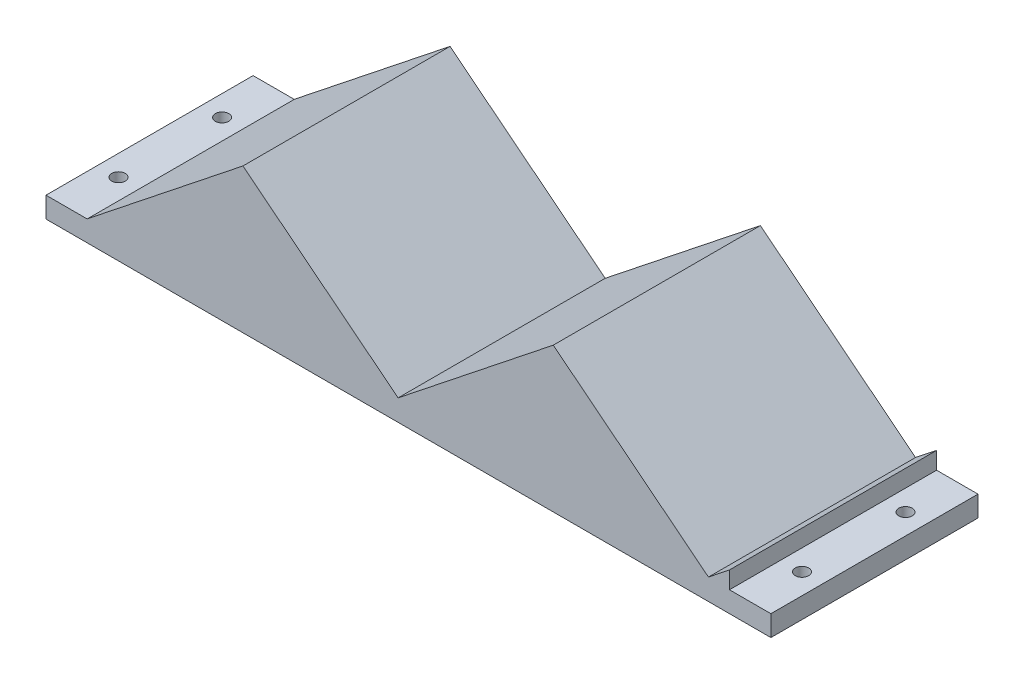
ISO-10303-21;
HEADER;
FILE_DESCRIPTION(('STEP AP214'),'2;1');
FILE_NAME('part.step','',(''),(''),'','','');
FILE_SCHEMA(('AUTOMOTIVE_DESIGN { 1 0 10303 214 1 1 1 1 }'));
ENDSEC;
DATA;
#1=APPLICATION_CONTEXT('core data for automotive mechanical design processes');
#2=APPLICATION_PROTOCOL_DEFINITION('international standard','automotive_design',2000,#1);
#3=PRODUCT_CONTEXT('',#1,'mechanical');
#4=PRODUCT('Part','Part','',(#3));
#5=PRODUCT_RELATED_PRODUCT_CATEGORY('part','',(#4));
#6=PRODUCT_DEFINITION_FORMATION('','',#4);
#7=PRODUCT_DEFINITION_CONTEXT('part definition',#1,'design');
#8=PRODUCT_DEFINITION('design','',#6,#7);
#9=PRODUCT_DEFINITION_SHAPE('','',#8);
#10=(LENGTH_UNIT() NAMED_UNIT(*) SI_UNIT(.MILLI.,.METRE.));
#11=(NAMED_UNIT(*) PLANE_ANGLE_UNIT() SI_UNIT($,.RADIAN.));
#12=(NAMED_UNIT(*) SI_UNIT($,.STERADIAN.) SOLID_ANGLE_UNIT());
#13=UNCERTAINTY_MEASURE_WITH_UNIT(LENGTH_MEASURE(1.E-05),#10,'distance_accuracy_value','');
#14=(GEOMETRIC_REPRESENTATION_CONTEXT(3) GLOBAL_UNCERTAINTY_ASSIGNED_CONTEXT((#13)) GLOBAL_UNIT_ASSIGNED_CONTEXT((#10,
#11,#12)) REPRESENTATION_CONTEXT('',''));
#15=CARTESIAN_POINT('',(0.,0.,0.));
#16=DIRECTION('',(0.,0.,1.));
#17=DIRECTION('',(1.,0.,0.));
#18=AXIS2_PLACEMENT_3D('',#15,#16,#17);
#19=CARTESIAN_POINT('',(75.080897,59.750065,100.));
#20=DIRECTION('',(-0.621900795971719,-0.783096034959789,0.));
#21=DIRECTION('',(0.783096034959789,-0.621900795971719,0.));
#22=AXIS2_PLACEMENT_3D('',#19,#20,#21);
#23=PLANE('',#22);
#24=DIRECTION('',(-0.783096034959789,0.621900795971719,0.));
#25=VECTOR('',#24,1.);
#26=CARTESIAN_POINT('',(75.080897,59.750065,0.));
#27=LINE('',#26,#25);
#28=CARTESIAN_POINT('',(150.005619,0.248111,0.));
#29=VERTEX_POINT('',#28);
#30=CARTESIAN_POINT('',(75.080897,59.750065,0.));
#31=VERTEX_POINT('',#30);
#32=EDGE_CURVE('E155',#29,#31,#27,.T.);
#33=ORIENTED_EDGE('',*,*,#32,.T.);
#34=DIRECTION('',(0.,0.,-1.));
#35=VECTOR('',#34,1.);
#36=CARTESIAN_POINT('',(75.080897,59.750065,100.));
#37=LINE('',#36,#35);
#38=CARTESIAN_POINT('',(75.080897,59.750065,100.));
#39=VERTEX_POINT('',#38);
#40=EDGE_CURVE('E11',#39,#31,#37,.T.);
#41=ORIENTED_EDGE('',*,*,#40,.F.);
#42=DIRECTION('',(-0.783096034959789,0.621900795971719,0.));
#43=VECTOR('',#42,1.);
#44=CARTESIAN_POINT('',(75.080897,59.750065,100.));
#45=LINE('',#44,#43);
#46=CARTESIAN_POINT('',(150.005619,0.248111,100.));
#47=VERTEX_POINT('',#46);
#48=EDGE_CURVE('E178',#47,#39,#45,.T.);
#49=ORIENTED_EDGE('',*,*,#48,.F.);
#50=DIRECTION('',(0.,0.,-1.));
#51=VECTOR('',#50,1.);
#52=CARTESIAN_POINT('',(150.005619,0.248111,100.));
#53=LINE('',#52,#51);
#54=EDGE_CURVE('E151',#47,#29,#53,.T.);
#55=ORIENTED_EDGE('',*,*,#54,.T.);
#56=EDGE_LOOP('',(#33,#41,#49,#55));
#57=FACE_BOUND('',#56,.T.);
#58=ADVANCED_FACE('F33',(#57),#23,.F.);
#59=CARTESIAN_POINT('',(0.,0.122664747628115,100.));
#60=DIRECTION('',(0.621909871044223,-0.783088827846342,0.));
#61=DIRECTION('',(0.783088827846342,0.621909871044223,0.));
#62=AXIS2_PLACEMENT_3D('',#59,#60,#61);
#63=PLANE('',#62);
#64=DIRECTION('',(-0.783088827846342,-0.621909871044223,0.));
#65=VECTOR('',#64,1.);
#66=CARTESIAN_POINT('',(0.,0.122664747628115,0.));
#67=LINE('',#66,#65);
#68=CARTESIAN_POINT('',(0.,0.122664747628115,0.));
#69=VERTEX_POINT('',#68);
#70=EDGE_CURVE('E158',#31,#69,#67,.T.);
#71=ORIENTED_EDGE('',*,*,#70,.T.);
#72=DIRECTION('',(0.,0.,-1.));
#73=VECTOR('',#72,1.);
#74=CARTESIAN_POINT('',(0.,0.122664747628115,100.));
#75=LINE('',#74,#73);
#76=CARTESIAN_POINT('',(0.,0.122664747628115,100.));
#77=VERTEX_POINT('',#76);
#78=EDGE_CURVE('E42',#77,#69,#75,.T.);
#79=ORIENTED_EDGE('',*,*,#78,.F.);
#80=DIRECTION('',(-0.783088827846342,-0.621909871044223,0.));
#81=VECTOR('',#80,1.);
#82=CARTESIAN_POINT('',(0.,0.122664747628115,100.));
#83=LINE('',#82,#81);
#84=EDGE_CURVE('E106',#39,#77,#83,.T.);
#85=ORIENTED_EDGE('',*,*,#84,.F.);
#86=ORIENTED_EDGE('',*,*,#40,.T.);
#87=EDGE_LOOP('',(#71,#79,#85,#86));
#88=FACE_BOUND('',#87,.T.);
#89=ADVANCED_FACE('F265',(#88),#63,.F.);
#90=CARTESIAN_POINT('',(0.,0.122664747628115,100.));
#91=DIRECTION('',(1.,0.,0.));
#92=DIRECTION('',(0.,0.,-1.));
#93=AXIS2_PLACEMENT_3D('',#90,#91,#92);
#94=PLANE('',#93);
#95=DIRECTION('',(0.,-1.,0.));
#96=VECTOR('',#95,1.);
#97=CARTESIAN_POINT('',(0.,0.122664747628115,0.));
#98=LINE('',#97,#96);
#99=CARTESIAN_POINT('',(0.,0.,0.));
#100=VERTEX_POINT('',#99);
#101=EDGE_CURVE('E161',#69,#100,#98,.T.);
#102=ORIENTED_EDGE('',*,*,#101,.T.);
#103=DIRECTION('',(0.,0.,-1.));
#104=VECTOR('',#103,1.);
#105=CARTESIAN_POINT('',(0.,0.,100.));
#106=LINE('',#105,#104);
#107=CARTESIAN_POINT('',(0.,0.,100.));
#108=VERTEX_POINT('',#107);
#109=EDGE_CURVE('E197',#108,#100,#106,.T.);
#110=ORIENTED_EDGE('',*,*,#109,.F.);
#111=DIRECTION('',(0.,-1.,0.));
#112=VECTOR('',#111,1.);
#113=CARTESIAN_POINT('',(0.,0.122664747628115,100.));
#114=LINE('',#113,#112);
#115=EDGE_CURVE('E226',#77,#108,#114,.T.);
#116=ORIENTED_EDGE('',*,*,#115,.F.);
#117=ORIENTED_EDGE('',*,*,#78,.T.);
#118=EDGE_LOOP('',(#102,#110,#116,#117));
#119=FACE_BOUND('',#118,.T.);
#120=ADVANCED_FACE('F269',(#119),#94,.F.);
#121=CARTESIAN_POINT('',(0.,0.,100.));
#122=DIRECTION('',(0.,-1.,0.));
#123=DIRECTION('',(0.,0.,-1.));
#124=AXIS2_PLACEMENT_3D('',#121,#122,#123);
#125=PLANE('',#124);
#126=CARTESIAN_POINT('',(-10.,0.,25.));
#127=DIRECTION('',(0.,-1.,0.));
#128=DIRECTION('',(0.,0.,-1.));
#129=AXIS2_PLACEMENT_3D('',#126,#127,#128);
#130=CIRCLE('',#129,3.25);
#131=CARTESIAN_POINT('',(-10.,0.,21.75));
#132=VERTEX_POINT('',#131);
#133=EDGE_CURVE('E159',#132,#132,#130,.T.);
#134=ORIENTED_EDGE('',*,*,#133,.T.);
#135=EDGE_LOOP('',(#134));
#136=FACE_BOUND('',#135,.T.);
#137=CARTESIAN_POINT('',(-10.,0.,75.));
#138=DIRECTION('',(0.,-1.,0.));
#139=DIRECTION('',(0.,0.,-1.));
#140=AXIS2_PLACEMENT_3D('',#137,#138,#139);
#141=CIRCLE('',#140,3.25);
#142=CARTESIAN_POINT('',(-10.,0.,71.75));
#143=VERTEX_POINT('',#142);
#144=EDGE_CURVE('E211',#143,#143,#141,.T.);
#145=ORIENTED_EDGE('',*,*,#144,.T.);
#146=EDGE_LOOP('',(#145));
#147=FACE_BOUND('',#146,.T.);
#148=DIRECTION('',(-1.,0.,0.));
#149=VECTOR('',#148,1.);
#150=CARTESIAN_POINT('',(0.,0.,0.));
#151=LINE('',#150,#149);
#152=CARTESIAN_POINT('',(-20.,0.,0.));
#153=VERTEX_POINT('',#152);
#154=EDGE_CURVE('E163',#100,#153,#151,.T.);
#155=ORIENTED_EDGE('',*,*,#154,.T.);
#156=DIRECTION('',(0.,0.,-1.));
#157=VECTOR('',#156,1.);
#158=CARTESIAN_POINT('',(-20.,0.,100.));
#159=LINE('',#158,#157);
#160=CARTESIAN_POINT('',(-20.,0.,100.));
#161=VERTEX_POINT('',#160);
#162=EDGE_CURVE('E194',#161,#153,#159,.T.);
#163=ORIENTED_EDGE('',*,*,#162,.F.);
#164=DIRECTION('',(-1.,0.,0.));
#165=VECTOR('',#164,1.);
#166=CARTESIAN_POINT('',(0.,0.,100.));
#167=LINE('',#166,#165);
#168=EDGE_CURVE('E228',#108,#161,#167,.T.);
#169=ORIENTED_EDGE('',*,*,#168,.F.);
#170=ORIENTED_EDGE('',*,*,#109,.T.);
#171=EDGE_LOOP('',(#155,#163,#169,#170));
#172=FACE_BOUND('',#171,.T.);
#173=ADVANCED_FACE('F273',(#136,#147,#172),#125,.F.);
#174=CARTESIAN_POINT('',(-20.,0.,100.));
#175=DIRECTION('',(1.,0.,0.));
#176=DIRECTION('',(0.,0.,-1.));
#177=AXIS2_PLACEMENT_3D('',#174,#175,#176);
#178=PLANE('',#177);
#179=DIRECTION('',(0.,-1.,0.));
#180=VECTOR('',#179,1.);
#181=CARTESIAN_POINT('',(-20.,0.,0.));
#182=LINE('',#181,#180);
#183=CARTESIAN_POINT('',(-20.,-10.,0.));
#184=VERTEX_POINT('',#183);
#185=EDGE_CURVE('E165',#153,#184,#182,.T.);
#186=ORIENTED_EDGE('',*,*,#185,.T.);
#187=DIRECTION('',(0.,0.,-1.));
#188=VECTOR('',#187,1.);
#189=CARTESIAN_POINT('',(-20.,-10.,100.));
#190=LINE('',#189,#188);
#191=CARTESIAN_POINT('',(-20.,-10.,100.));
#192=VERTEX_POINT('',#191);
#193=EDGE_CURVE('E191',#192,#184,#190,.T.);
#194=ORIENTED_EDGE('',*,*,#193,.F.);
#195=DIRECTION('',(0.,-1.,0.));
#196=VECTOR('',#195,1.);
#197=CARTESIAN_POINT('',(-20.,0.,100.));
#198=LINE('',#197,#196);
#199=EDGE_CURVE('E230',#161,#192,#198,.T.);
#200=ORIENTED_EDGE('',*,*,#199,.F.);
#201=ORIENTED_EDGE('',*,*,#162,.T.);
#202=EDGE_LOOP('',(#186,#194,#200,#201));
#203=FACE_BOUND('',#202,.T.);
#204=ADVANCED_FACE('F279',(#203),#178,.F.);
#205=CARTESIAN_POINT('',(-20.,-10.,100.));
#206=DIRECTION('',(0.,1.,0.));
#207=DIRECTION('',(0.,0.,1.));
#208=AXIS2_PLACEMENT_3D('',#205,#206,#207);
#209=PLANE('',#208);
#210=CARTESIAN_POINT('',(320.,-10.,75.));
#211=DIRECTION('',(0.,1.,0.));
#212=DIRECTION('',(0.,0.,1.));
#213=AXIS2_PLACEMENT_3D('',#210,#211,#212);
#214=CIRCLE('',#213,3.25000000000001);
#215=CARTESIAN_POINT('',(320.,-10.,78.25));
#216=VERTEX_POINT('',#215);
#217=EDGE_CURVE('E208',#216,#216,#214,.T.);
#218=ORIENTED_EDGE('',*,*,#217,.T.);
#219=EDGE_LOOP('',(#218));
#220=FACE_BOUND('',#219,.T.);
#221=CARTESIAN_POINT('',(320.,-10.,25.));
#222=DIRECTION('',(0.,1.,0.));
#223=DIRECTION('',(0.,0.,1.));
#224=AXIS2_PLACEMENT_3D('',#221,#222,#223);
#225=CIRCLE('',#224,3.25000000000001);
#226=CARTESIAN_POINT('',(320.,-10.,28.25));
#227=VERTEX_POINT('',#226);
#228=EDGE_CURVE('E205',#227,#227,#225,.T.);
#229=ORIENTED_EDGE('',*,*,#228,.T.);
#230=EDGE_LOOP('',(#229));
#231=FACE_BOUND('',#230,.T.);
#232=CARTESIAN_POINT('',(-10.,-10.,25.));
#233=DIRECTION('',(0.,1.,0.));
#234=DIRECTION('',(0.,0.,1.));
#235=AXIS2_PLACEMENT_3D('',#232,#233,#234);
#236=CIRCLE('',#235,3.25);
#237=CARTESIAN_POINT('',(-10.,-10.,28.25));
#238=VERTEX_POINT('',#237);
#239=EDGE_CURVE('E36',#238,#238,#236,.T.);
#240=ORIENTED_EDGE('',*,*,#239,.T.);
#241=EDGE_LOOP('',(#240));
#242=FACE_BOUND('',#241,.T.);
#243=CARTESIAN_POINT('',(-10.,-10.,75.));
#244=DIRECTION('',(0.,1.,0.));
#245=DIRECTION('',(0.,0.,1.));
#246=AXIS2_PLACEMENT_3D('',#243,#244,#245);
#247=CIRCLE('',#246,3.25);
#248=CARTESIAN_POINT('',(-10.,-10.,78.25));
#249=VERTEX_POINT('',#248);
#250=EDGE_CURVE('E209',#249,#249,#247,.T.);
#251=ORIENTED_EDGE('',*,*,#250,.T.);
#252=EDGE_LOOP('',(#251));
#253=FACE_BOUND('',#252,.T.);
#254=DIRECTION('',(1.,0.,0.));
#255=VECTOR('',#254,1.);
#256=CARTESIAN_POINT('',(-20.,-10.,0.));
#257=LINE('',#256,#255);
#258=CARTESIAN_POINT('',(330.,-10.,0.));
#259=VERTEX_POINT('',#258);
#260=EDGE_CURVE('E167',#184,#259,#257,.T.);
#261=ORIENTED_EDGE('',*,*,#260,.T.);
#262=DIRECTION('',(0.,0.,-1.));
#263=VECTOR('',#262,1.);
#264=CARTESIAN_POINT('',(330.,-10.,100.));
#265=LINE('',#264,#263);
#266=CARTESIAN_POINT('',(330.,-10.,100.));
#267=VERTEX_POINT('',#266);
#268=EDGE_CURVE('E188',#267,#259,#265,.T.);
#269=ORIENTED_EDGE('',*,*,#268,.F.);
#270=DIRECTION('',(1.,0.,0.));
#271=VECTOR('',#270,1.);
#272=CARTESIAN_POINT('',(-20.,-10.,100.));
#273=LINE('',#272,#271);
#274=EDGE_CURVE('E232',#192,#267,#273,.T.);
#275=ORIENTED_EDGE('',*,*,#274,.F.);
#276=ORIENTED_EDGE('',*,*,#193,.T.);
#277=EDGE_LOOP('',(#261,#269,#275,#276));
#278=FACE_BOUND('',#277,.T.);
#279=ADVANCED_FACE('F283',(#220,#231,#242,#253,#278),#209,.F.);
#280=CARTESIAN_POINT('',(330.,-10.,100.));
#281=DIRECTION('',(-1.,0.,0.));
#282=DIRECTION('',(0.,0.,1.));
#283=AXIS2_PLACEMENT_3D('',#280,#281,#282);
#284=PLANE('',#283);
#285=DIRECTION('',(0.,1.,0.));
#286=VECTOR('',#285,1.);
#287=CARTESIAN_POINT('',(330.,-10.,0.));
#288=LINE('',#287,#286);
#289=CARTESIAN_POINT('',(330.,0.,0.));
#290=VERTEX_POINT('',#289);
#291=EDGE_CURVE('E169',#259,#290,#288,.T.);
#292=ORIENTED_EDGE('',*,*,#291,.T.);
#293=DIRECTION('',(0.,0.,-1.));
#294=VECTOR('',#293,1.);
#295=CARTESIAN_POINT('',(330.,0.,100.));
#296=LINE('',#295,#294);
#297=CARTESIAN_POINT('',(330.,0.,100.));
#298=VERTEX_POINT('',#297);
#299=EDGE_CURVE('E185',#298,#290,#296,.T.);
#300=ORIENTED_EDGE('',*,*,#299,.F.);
#301=DIRECTION('',(0.,1.,0.));
#302=VECTOR('',#301,1.);
#303=CARTESIAN_POINT('',(330.,-10.,100.));
#304=LINE('',#303,#302);
#305=EDGE_CURVE('E234',#267,#298,#304,.T.);
#306=ORIENTED_EDGE('',*,*,#305,.F.);
#307=ORIENTED_EDGE('',*,*,#268,.T.);
#308=EDGE_LOOP('',(#292,#300,#306,#307));
#309=FACE_BOUND('',#308,.T.);
#310=ADVANCED_FACE('F287',(#309),#284,.F.);
#311=CARTESIAN_POINT('',(330.,0.,100.));
#312=DIRECTION('',(0.,-1.,0.));
#313=DIRECTION('',(0.,0.,-1.));
#314=AXIS2_PLACEMENT_3D('',#311,#312,#313);
#315=PLANE('',#314);
#316=CARTESIAN_POINT('',(320.,0.,75.));
#317=DIRECTION('',(0.,-1.,0.));
#318=DIRECTION('',(0.,0.,-1.));
#319=AXIS2_PLACEMENT_3D('',#316,#317,#318);
#320=CIRCLE('',#319,3.25000000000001);
#321=CARTESIAN_POINT('',(320.,0.,71.75));
#322=VERTEX_POINT('',#321);
#323=EDGE_CURVE('E206',#322,#322,#320,.T.);
#324=ORIENTED_EDGE('',*,*,#323,.T.);
#325=EDGE_LOOP('',(#324));
#326=FACE_BOUND('',#325,.T.);
#327=CARTESIAN_POINT('',(320.,0.,25.));
#328=DIRECTION('',(0.,-1.,0.));
#329=DIRECTION('',(0.,0.,-1.));
#330=AXIS2_PLACEMENT_3D('',#327,#328,#329);
#331=CIRCLE('',#330,3.25000000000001);
#332=CARTESIAN_POINT('',(320.,0.,21.75));
#333=VERTEX_POINT('',#332);
#334=EDGE_CURVE('E202',#333,#333,#331,.T.);
#335=ORIENTED_EDGE('',*,*,#334,.T.);
#336=EDGE_LOOP('',(#335));
#337=FACE_BOUND('',#336,.T.);
#338=DIRECTION('',(-1.,0.,0.));
#339=VECTOR('',#338,1.);
#340=CARTESIAN_POINT('',(330.,0.,0.));
#341=LINE('',#340,#339);
#342=CARTESIAN_POINT('',(310.,0.,0.));
#343=VERTEX_POINT('',#342);
#344=EDGE_CURVE('E171',#290,#343,#341,.T.);
#345=ORIENTED_EDGE('',*,*,#344,.T.);
#346=DIRECTION('',(0.,0.,-1.));
#347=VECTOR('',#346,1.);
#348=CARTESIAN_POINT('',(310.,0.,100.));
#349=LINE('',#348,#347);
#350=CARTESIAN_POINT('',(310.,0.,100.));
#351=VERTEX_POINT('',#350);
#352=EDGE_CURVE('E182',#351,#343,#349,.T.);
#353=ORIENTED_EDGE('',*,*,#352,.F.);
#354=DIRECTION('',(-1.,0.,0.));
#355=VECTOR('',#354,1.);
#356=CARTESIAN_POINT('',(330.,0.,100.));
#357=LINE('',#356,#355);
#358=EDGE_CURVE('E236',#298,#351,#357,.T.);
#359=ORIENTED_EDGE('',*,*,#358,.F.);
#360=ORIENTED_EDGE('',*,*,#299,.T.);
#361=EDGE_LOOP('',(#345,#353,#359,#360));
#362=FACE_BOUND('',#361,.T.);
#363=ADVANCED_FACE('F242',(#326,#337,#362),#315,.F.);
#364=CARTESIAN_POINT('',(310.,0.,100.));
#365=DIRECTION('',(-1.,0.,0.));
#366=DIRECTION('',(0.,0.,1.));
#367=AXIS2_PLACEMENT_3D('',#364,#365,#366);
#368=PLANE('',#367);
#369=DIRECTION('',(0.,1.,0.));
#370=VECTOR('',#369,1.);
#371=CARTESIAN_POINT('',(310.,0.,0.));
#372=LINE('',#371,#370);
#373=CARTESIAN_POINT('',(310.,8.29421128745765,0.));
#374=VERTEX_POINT('',#373);
#375=EDGE_CURVE('E173',#343,#374,#372,.T.);
#376=ORIENTED_EDGE('',*,*,#375,.T.);
#377=DIRECTION('',(0.,0.,-1.));
#378=VECTOR('',#377,1.);
#379=CARTESIAN_POINT('',(310.,8.29421128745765,100.));
#380=LINE('',#379,#378);
#381=CARTESIAN_POINT('',(310.,8.29421128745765,100.));
#382=VERTEX_POINT('',#381);
#383=EDGE_CURVE('E146',#382,#374,#380,.T.);
#384=ORIENTED_EDGE('',*,*,#383,.F.);
#385=DIRECTION('',(0.,1.,0.));
#386=VECTOR('',#385,1.);
#387=CARTESIAN_POINT('',(310.,0.,100.));
#388=LINE('',#387,#386);
#389=EDGE_CURVE('E137',#351,#382,#388,.T.);
#390=ORIENTED_EDGE('',*,*,#389,.F.);
#391=ORIENTED_EDGE('',*,*,#352,.T.);
#392=EDGE_LOOP('',(#376,#384,#390,#391));
#393=FACE_BOUND('',#392,.T.);
#394=ADVANCED_FACE('F246',(#393),#368,.F.);
#395=CARTESIAN_POINT('',(299.8551,0.248111,100.));
#396=DIRECTION('',(0.621401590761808,-0.783492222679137,0.));
#397=DIRECTION('',(0.783492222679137,0.621401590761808,0.));
#398=AXIS2_PLACEMENT_3D('',#395,#396,#397);
#399=PLANE('',#398);
#400=DIRECTION('',(-0.783492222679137,-0.621401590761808,0.));
#401=VECTOR('',#400,1.);
#402=CARTESIAN_POINT('',(299.8551,0.248111,0.));
#403=LINE('',#402,#401);
#404=CARTESIAN_POINT('',(299.8551,0.248111,0.));
#405=VERTEX_POINT('',#404);
#406=EDGE_CURVE('E145',#374,#405,#403,.T.);
#407=ORIENTED_EDGE('',*,*,#406,.T.);
#408=DIRECTION('',(0.,0.,-1.));
#409=VECTOR('',#408,1.);
#410=CARTESIAN_POINT('',(299.8551,0.248111,100.));
#411=LINE('',#410,#409);
#412=CARTESIAN_POINT('',(299.8551,0.248111,100.));
#413=VERTEX_POINT('',#412);
#414=EDGE_CURVE('E142',#413,#405,#411,.T.);
#415=ORIENTED_EDGE('',*,*,#414,.F.);
#416=DIRECTION('',(-0.783492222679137,-0.621401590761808,0.));
#417=VECTOR('',#416,1.);
#418=CARTESIAN_POINT('',(299.8551,0.248111,100.));
#419=LINE('',#418,#417);
#420=EDGE_CURVE('E131',#382,#413,#419,.T.);
#421=ORIENTED_EDGE('',*,*,#420,.F.);
#422=ORIENTED_EDGE('',*,*,#383,.T.);
#423=EDGE_LOOP('',(#407,#415,#421,#422));
#424=FACE_BOUND('',#423,.T.);
#425=ADVANCED_FACE('F143',(#424),#399,.F.);
#426=CARTESIAN_POINT('',(224.930341,59.750065,100.));
#427=DIRECTION('',(-0.621900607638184,-0.78309618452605,0.));
#428=DIRECTION('',(0.78309618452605,-0.621900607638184,0.));
#429=AXIS2_PLACEMENT_3D('',#426,#427,#428);
#430=PLANE('',#429);
#431=DIRECTION('',(-0.78309618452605,0.621900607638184,0.));
#432=VECTOR('',#431,1.);
#433=CARTESIAN_POINT('',(224.930341,59.750065,0.));
#434=LINE('',#433,#432);
#435=CARTESIAN_POINT('',(224.930341,59.750065,0.));
#436=VERTEX_POINT('',#435);
#437=EDGE_CURVE('E92',#405,#436,#434,.T.);
#438=ORIENTED_EDGE('',*,*,#437,.T.);
#439=DIRECTION('',(0.,0.,-1.));
#440=VECTOR('',#439,1.);
#441=CARTESIAN_POINT('',(224.930341,59.750065,100.));
#442=LINE('',#441,#440);
#443=CARTESIAN_POINT('',(224.930341,59.750065,100.));
#444=VERTEX_POINT('',#443);
#445=EDGE_CURVE('E147',#444,#436,#442,.T.);
#446=ORIENTED_EDGE('',*,*,#445,.F.);
#447=DIRECTION('',(-0.78309618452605,0.621900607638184,0.));
#448=VECTOR('',#447,1.);
#449=CARTESIAN_POINT('',(224.930341,59.750065,100.));
#450=LINE('',#449,#448);
#451=EDGE_CURVE('E135',#413,#444,#450,.T.);
#452=ORIENTED_EDGE('',*,*,#451,.F.);
#453=ORIENTED_EDGE('',*,*,#414,.T.);
#454=EDGE_LOOP('',(#438,#446,#452,#453));
#455=FACE_BOUND('',#454,.T.);
#456=ADVANCED_FACE('F149',(#455),#430,.F.);
#457=CARTESIAN_POINT('',(150.005619,0.248111,100.));
#458=DIRECTION('',(0.621900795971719,-0.783096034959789,0.));
#459=DIRECTION('',(0.783096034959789,0.621900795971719,0.));
#460=AXIS2_PLACEMENT_3D('',#457,#458,#459);
#461=PLANE('',#460);
#462=DIRECTION('',(-0.783096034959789,-0.621900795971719,0.));
#463=VECTOR('',#462,1.);
#464=CARTESIAN_POINT('',(150.005619,0.248111,0.));
#465=LINE('',#464,#463);
#466=EDGE_CURVE('E98',#436,#29,#465,.T.);
#467=ORIENTED_EDGE('',*,*,#466,.T.);
#468=ORIENTED_EDGE('',*,*,#54,.F.);
#469=DIRECTION('',(-0.783096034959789,-0.621900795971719,0.));
#470=VECTOR('',#469,1.);
#471=CARTESIAN_POINT('',(150.005619,0.248111,100.));
#472=LINE('',#471,#470);
#473=EDGE_CURVE('E51',#444,#47,#472,.T.);
#474=ORIENTED_EDGE('',*,*,#473,.F.);
#475=ORIENTED_EDGE('',*,*,#445,.T.);
#476=EDGE_LOOP('',(#467,#468,#474,#475));
#477=FACE_BOUND('',#476,.T.);
#478=ADVANCED_FACE('F254',(#477),#461,.F.);
#479=CARTESIAN_POINT('',(0.,0.,100.));
#480=DIRECTION('',(0.,0.,1.));
#481=DIRECTION('',(1.,0.,0.));
#482=AXIS2_PLACEMENT_3D('',#479,#480,#481);
#483=PLANE('',#482);
#484=ORIENTED_EDGE('',*,*,#48,.T.);
#485=ORIENTED_EDGE('',*,*,#84,.T.);
#486=ORIENTED_EDGE('',*,*,#115,.T.);
#487=ORIENTED_EDGE('',*,*,#168,.T.);
#488=ORIENTED_EDGE('',*,*,#199,.T.);
#489=ORIENTED_EDGE('',*,*,#274,.T.);
#490=ORIENTED_EDGE('',*,*,#305,.T.);
#491=ORIENTED_EDGE('',*,*,#358,.T.);
#492=ORIENTED_EDGE('',*,*,#389,.T.);
#493=ORIENTED_EDGE('',*,*,#420,.T.);
#494=ORIENTED_EDGE('',*,*,#451,.T.);
#495=ORIENTED_EDGE('',*,*,#473,.T.);
#496=EDGE_LOOP('',(#484,#485,#486,#487,#488,#489,#490,#491,#492,#493,#494,#495));
#497=FACE_BOUND('',#496,.T.);
#498=ADVANCED_FACE('F133',(#497),#483,.T.);
#499=CARTESIAN_POINT('',(0.,0.,0.));
#500=DIRECTION('',(0.,0.,1.));
#501=DIRECTION('',(1.,0.,0.));
#502=AXIS2_PLACEMENT_3D('',#499,#500,#501);
#503=PLANE('',#502);
#504=ORIENTED_EDGE('',*,*,#32,.F.);
#505=ORIENTED_EDGE('',*,*,#466,.F.);
#506=ORIENTED_EDGE('',*,*,#437,.F.);
#507=ORIENTED_EDGE('',*,*,#406,.F.);
#508=ORIENTED_EDGE('',*,*,#375,.F.);
#509=ORIENTED_EDGE('',*,*,#344,.F.);
#510=ORIENTED_EDGE('',*,*,#291,.F.);
#511=ORIENTED_EDGE('',*,*,#260,.F.);
#512=ORIENTED_EDGE('',*,*,#185,.F.);
#513=ORIENTED_EDGE('',*,*,#154,.F.);
#514=ORIENTED_EDGE('',*,*,#101,.F.);
#515=ORIENTED_EDGE('',*,*,#70,.F.);
#516=EDGE_LOOP('',(#504,#505,#506,#507,#508,#509,#510,#511,#512,#513,#514,#515));
#517=FACE_BOUND('',#516,.T.);
#518=ADVANCED_FACE('F249',(#517),#503,.F.);
#519=CARTESIAN_POINT('',(320.,59.750065,25.));
#520=DIRECTION('',(0.,-1.,0.));
#521=DIRECTION('',(0.,0.,-1.));
#522=AXIS2_PLACEMENT_3D('',#519,#520,#521);
#523=CYLINDRICAL_SURFACE('',#522,3.25000000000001);
#524=ORIENTED_EDGE('',*,*,#334,.F.);
#525=EDGE_LOOP('',(#524));
#526=FACE_BOUND('',#525,.T.);
#527=ORIENTED_EDGE('',*,*,#228,.F.);
#528=EDGE_LOOP('',(#527));
#529=FACE_BOUND('',#528,.T.);
#530=ADVANCED_FACE('F324',(#526,#529),#523,.F.);
#531=CARTESIAN_POINT('',(320.,59.750065,75.));
#532=DIRECTION('',(0.,-1.,0.));
#533=DIRECTION('',(0.,0.,-1.));
#534=AXIS2_PLACEMENT_3D('',#531,#532,#533);
#535=CYLINDRICAL_SURFACE('',#534,3.25000000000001);
#536=ORIENTED_EDGE('',*,*,#323,.F.);
#537=EDGE_LOOP('',(#536));
#538=FACE_BOUND('',#537,.T.);
#539=ORIENTED_EDGE('',*,*,#217,.F.);
#540=EDGE_LOOP('',(#539));
#541=FACE_BOUND('',#540,.T.);
#542=ADVANCED_FACE('F354',(#538,#541),#535,.F.);
#543=CARTESIAN_POINT('',(-10.,59.750065,75.));
#544=DIRECTION('',(0.,-1.,0.));
#545=DIRECTION('',(0.,0.,-1.));
#546=AXIS2_PLACEMENT_3D('',#543,#544,#545);
#547=CYLINDRICAL_SURFACE('',#546,3.25);
#548=ORIENTED_EDGE('',*,*,#250,.F.);
#549=EDGE_LOOP('',(#548));
#550=FACE_BOUND('',#549,.T.);
#551=ORIENTED_EDGE('',*,*,#144,.F.);
#552=EDGE_LOOP('',(#551));
#553=FACE_BOUND('',#552,.T.);
#554=ADVANCED_FACE('F364',(#550,#553),#547,.F.);
#555=CARTESIAN_POINT('',(-10.,59.750065,25.));
#556=DIRECTION('',(0.,-1.,0.));
#557=DIRECTION('',(0.,0.,-1.));
#558=AXIS2_PLACEMENT_3D('',#555,#556,#557);
#559=CYLINDRICAL_SURFACE('',#558,3.25);
#560=ORIENTED_EDGE('',*,*,#239,.F.);
#561=EDGE_LOOP('',(#560));
#562=FACE_BOUND('',#561,.T.);
#563=ORIENTED_EDGE('',*,*,#133,.F.);
#564=EDGE_LOOP('',(#563));
#565=FACE_BOUND('',#564,.T.);
#566=ADVANCED_FACE('F374',(#562,#565),#559,.F.);
#567=CLOSED_SHELL('',(#58,#89,#120,#173,#204,#279,#310,#363,#394,#425,#456,#478,#498,#518,#530,
#542,#554,#566));
#568=MANIFOLD_SOLID_BREP('B2',#567);
#569=ADVANCED_BREP_SHAPE_REPRESENTATION('',(#18,#568),#14);
#570=SHAPE_DEFINITION_REPRESENTATION(#9,#569);
ENDSEC;
END-ISO-10303-21;
